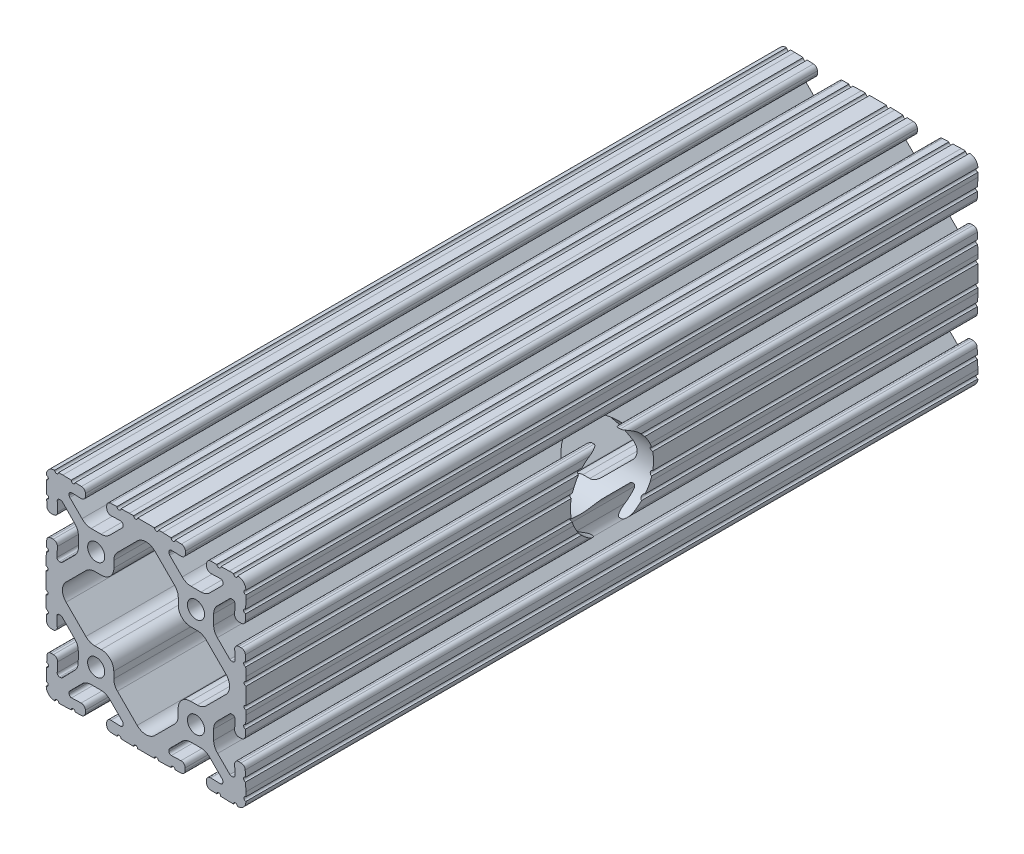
from build123d import *

# Parameters (mm, degrees)
SKETCH2_R           = 3.2639
EXTRUDE2_DEPTH      = 279.4
EXTRUDE3_DEPTH      = 296.237728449
EXTRUDE3_DEPTH_BACK = 296.237728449
SKETCH3_R           = 15.875


with BuildPart() as part:
    # Sketch2 → Extrude2 (new body)
    with BuildSketch(Plane.XY):
        with BuildLine():
            Line((52.454414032, 57.140691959), (50.810145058, 57.140983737))
            Line((50.810145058, 57.140983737), (47.609261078, 57.029766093))
            ThreePointArc((47.609261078, 57.029766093), (46.874190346, 56.241805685), (46.086180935, 56.976823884))
            Line((46.086180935, 56.976823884), (43.693943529, 56.893713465))
            ThreePointArc((43.693943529, 56.893713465), (42.61600037, 56.414012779), (42.173821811, 55.320142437))
            Line((42.173821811, 55.320142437), (42.173659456, 54.405215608))
            ThreePointArc((42.173659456, 54.405215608), (42.654306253, 53.272318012), (43.803128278, 52.831085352))
            Line((43.803128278, 52.831085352), (47.476383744, 52.95867854))
            ThreePointArc((47.476383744, 52.95867854), (48.124912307, 52.709595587), (48.396245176, 52.070056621))
            Line((48.396245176, 52.070056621), (48.396165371, 51.620327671))
            ThreePointArc((48.396165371, 51.620327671), (48.328434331, 51.280135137), (48.135673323, 50.991757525))
            Line((48.135673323, 50.991757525), (43.369419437, 46.227171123))
            ThreePointArc((43.369419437, 46.227171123), (41.828287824, 45.197811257), (40.010548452, 44.836574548))
            Line((40.010548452, 44.836574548), (36.205374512, 44.837249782))
            ThreePointArc((36.205374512, 44.837249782), (34.387769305, 45.199129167), (32.847006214, 46.229029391))
            Line((32.847006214, 46.229029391), (28.08241092, 50.995314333))
            ThreePointArc((28.08241092, 50.995314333), (27.889751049, 51.28376092), (27.822140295, 51.623978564))
            Line((27.822140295, 51.623978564), (27.822224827, 52.1003435))
            ThreePointArc((27.822224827, 52.1003435), (28.093786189, 52.73978761), (28.742405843, 52.988638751))
            Line((28.742405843, 52.988638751), (32.415629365, 52.859723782))
            ThreePointArc((32.415629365, 52.859723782), (33.564612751, 53.300545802), (34.045664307, 54.43327537))
            Line((34.045664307, 54.43327537), (34.045826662, 55.348199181))
            ThreePointArc((34.045826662, 55.348199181), (33.60404324, 56.442219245), (32.526283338, 56.922308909))
            Line((32.526283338, 56.922308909), (30.134056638, 57.006299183))
            ThreePointArc((30.134056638, 57.006299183), (29.345798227, 56.271548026), (28.610994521, 57.059757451))
            Line((28.610994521, 57.059757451), (25.410153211, 57.189179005))
            Line((25.410153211, 57.189179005), (23.784553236, 57.189467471))
            ThreePointArc((23.784553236, 57.189467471), (23.022418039, 56.4276535), (22.26055326, 57.189737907))
            Line((22.26055326, 57.189737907), (15.820815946, 57.195300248))
            ThreePointArc((15.820815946, 57.195300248), (15.058731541, 56.433435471), (14.296815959, 57.195469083))
            Line((14.296815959, 57.195469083), (12.671215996, 57.19585915))
            Line((12.671215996, 57.19585915), (9.470332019, 57.084666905))
            ThreePointArc((9.470332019, 57.084666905), (8.735248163, 56.296718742), (7.947250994, 57.031750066))
            Line((7.947250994, 57.031750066), (5.554994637, 56.948608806))
            ThreePointArc((5.554994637, 56.948608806), (4.477064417, 56.468901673), (4.034892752, 55.375038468))
            Line((4.034892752, 55.375038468), (4.034730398, 54.460116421))
            ThreePointArc((4.034730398, 54.460116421), (4.515381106, 53.327215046), (5.66421009, 52.885986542))
            Line((5.66421009, 52.885986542), (9.337473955, 53.013605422))
            ThreePointArc((9.337473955, 53.013605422), (9.986006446, 52.764524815), (10.257341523, 52.124983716))
            Line((10.257341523, 52.124983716), (10.25725699, 51.64860928))
            ThreePointArc((10.25725699, 51.64860928), (10.189525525, 51.308415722), (9.996763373, 51.020037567))
            Line((9.996763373, 51.020037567), (5.230478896, 46.255444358))
            ThreePointArc((5.230478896, 46.255444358), (3.689350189, 45.226090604), (1.871616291, 44.864856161))
            Line((1.871616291, 44.864856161), (-1.9295089, 44.865530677))
            ThreePointArc((-1.9295089, 44.865530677), (-3.824330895, 45.260212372), (-5.404383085, 46.37804917))
            Line((-5.404383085, 46.37804917), (-10.055977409, 51.023051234))
            ThreePointArc((-10.055977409, 51.023051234), (-10.248872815, 51.300534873), (-10.316797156, 51.631581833))
            Line((-10.316797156, 51.631581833), (-10.316717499, 52.080476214))
            ThreePointArc((-10.316717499, 52.080476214), (-10.045157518, 52.719918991), (-9.396540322, 52.9687716))
            Line((-9.396540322, 52.9687716), (-5.723306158, 52.839872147))
            ThreePointArc((-5.723306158, 52.839872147), (-4.574327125, 53.280696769), (-4.093278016, 54.413423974))
            Line((-4.093278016, 54.413423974), (-4.093115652, 55.328398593))
            ThreePointArc((-4.093115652, 55.328398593), (-4.534916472, 56.42243668), (-5.612709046, 56.902510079))
            Line((-5.612709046, 56.902510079), (-8.004886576, 56.986422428))
            ThreePointArc((-8.004886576, 56.986422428), (-8.793157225, 56.251684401), (-9.527947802, 57.039906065))
            Line((-9.527947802, 57.039906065), (-12.708548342, 57.152255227))
            Line((-12.708548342, 57.152255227), (-14.334148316, 57.152543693))
            ThreePointArc((-14.334148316, 57.152543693), (-15.096232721, 56.390678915), (-15.858148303, 57.152712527))
            ThreePointArc((-15.858148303, 57.152712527), (-18.107533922, 56.228658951), (-19.035674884, 53.980956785))
            ThreePointArc((-19.035674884, 53.980956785), (-18.275033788, 53.217651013), (-19.038288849, 52.456959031))
            Line((-19.038288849, 52.456959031), (-19.040964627, 50.852900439))
            Line((-19.040964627, 50.852900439), (-18.934455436, 47.651856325))
            ThreePointArc((-18.934455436, 47.651856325), (-18.147577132, 46.91562734), (-18.883753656, 46.128699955))
            Line((-18.883753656, 46.128699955), (-18.804162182, 43.736342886))
            ThreePointArc((-18.804162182, 43.736342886), (-18.326047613, 42.657695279), (-17.232828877, 42.213908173))
            Line((-17.232828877, 42.213908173), (-16.317903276, 42.212400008))
            ThreePointArc((-16.317903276, 42.212400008), (-15.184299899, 42.691379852), (-14.74137786, 43.839551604))
            Line((-14.74137786, 43.839551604), (-14.863567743, 47.512990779))
            ThreePointArc((-14.863567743, 47.512990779), (-14.613531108, 48.161152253), (-13.973593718, 48.4315441))
            Line((-13.973593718, 48.4315441), (-13.523865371, 48.430802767))
            ThreePointArc((-13.523865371, 48.430802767), (-13.182899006, 48.362205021), (-12.894344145, 48.168041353))
            Line((-12.894344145, 48.168041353), (-8.158352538, 43.396132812))
            ThreePointArc((-8.158352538, 43.396132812), (-7.13126071, 41.853488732), (-6.772698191, 40.035219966))
            Line((-6.772698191, 40.035219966), (-6.778970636, 36.230051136))
            ThreePointArc((-6.778970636, 36.230051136), (-7.143523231, 34.412980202), (-8.175688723, 32.873733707))
            Line((-8.175688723, 32.873733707), (-12.948976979, 28.116154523))
            ThreePointArc((-12.948976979, 28.116154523), (-13.237706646, 27.92391915), (-13.578023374, 27.856808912))
            Line((-13.578023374, 27.856808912), (-14.05438767, 27.857594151))
            ThreePointArc((-14.05438767, 27.857594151), (-14.693431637, 28.130095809), (-14.941328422, 28.779080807))
            Line((-14.941328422, 28.779080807), (-14.807010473, 32.452110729))
            ThreePointArc((-14.807010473, 32.452110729), (-15.246141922, 33.601741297), (-16.378162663, 34.084458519))
            Line((-16.378162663, 34.084458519), (-17.293085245, 34.085966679))
            ThreePointArc((-17.293085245, 34.085966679), (-18.387753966, 33.645792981), (-18.869428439, 32.568740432))
            Line((-18.869428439, 32.568740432), (-18.956937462, 30.176639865))
            ThreePointArc((-18.956937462, 30.176639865), (-18.223346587, 29.387301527), (-19.012636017, 28.65365803))
            Line((-19.012636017, 28.65365803), (-19.129671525, 25.452982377))
            Line((-19.129671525, 25.452982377), (-19.132351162, 23.827384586))
            ThreePointArc((-19.132351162, 23.827384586), (-18.371659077, 23.064129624), (-19.134863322, 22.303386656))
            Line((-19.134863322, 22.303386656), (-19.145415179, 15.898175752))
            ThreePointArc((-19.145415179, 15.898175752), (-18.384672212, 15.134971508), (-19.147825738, 14.374177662))
            Line((-19.147825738, 14.374177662), (-19.150606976, 12.748580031))
            Line((-19.150606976, 12.748580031), (-19.044123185, 9.54753596))
            ThreePointArc((-19.044123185, 9.54753596), (-18.257257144, 8.811293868), (-18.993446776, 8.024378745))
            Line((-18.993446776, 8.024378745), (-18.91382449, 5.632002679))
            ThreePointArc((-18.91382449, 5.632002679), (-18.435703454, 4.553368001), (-17.342491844, 4.109587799))
            Line((-17.342491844, 4.109587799), (-16.427571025, 4.108079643))
            ThreePointArc((-16.427571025, 4.108079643), (-15.293963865, 4.587063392), (-14.851045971, 5.735242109))
            Line((-14.851045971, 5.735242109), (-14.973261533, 9.408689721))
            ThreePointArc((-14.973261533, 9.408689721), (-14.723227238, 10.056855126), (-14.083287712, 10.327249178))
            Line((-14.083287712, 10.327249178), (-13.606913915, 10.326463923))
            ThreePointArc((-13.606913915, 10.326463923), (-13.266820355, 10.258232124), (-12.978726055, 10.065045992))
            Line((-12.978726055, 10.065045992), (-8.221148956, 5.291758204))
            ThreePointArc((-8.221148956, 5.291758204), (-7.194063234, 3.749117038), (-6.835502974, 1.930853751))
            Line((-6.835502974, 1.930853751), (-6.841768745, -1.870266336))
            ThreePointArc((-6.841768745, -1.870266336), (-7.239237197, -3.764505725), (-8.359396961, -5.342911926))
            Line((-8.359396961, -5.342911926), (-12.897584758, -9.987676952))
            ThreePointArc((-12.897584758, -9.987676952), (-13.186508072, -10.180318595), (-13.527189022, -10.24757909))
            Line((-13.527189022, -10.24757909), (-13.976917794, -10.246837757))
            ThreePointArc((-13.976917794, -10.246837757), (-14.615960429, -9.974337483), (-14.863858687, -9.325354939))
            Line((-14.863858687, -9.325354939), (-14.729556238, -5.652314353))
            ThreePointArc((-14.729556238, -5.652314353), (-15.168690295, -4.502688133), (-16.300708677, -4.019973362))
            Line((-16.300708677, -4.019973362), (-17.215682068, -4.018465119))
            ThreePointArc((-17.215682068, -4.018465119), (-18.310368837, -4.458656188), (-18.792027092, -5.535741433))
            Line((-18.792027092, -5.535741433), (-18.879458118, -7.927792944))
            ThreePointArc((-18.879458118, -7.927792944), (-18.145880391, -8.717143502), (-18.935182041, -9.450773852))
            Line((-18.935182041, -9.450773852), (-19.052245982, -12.668543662))
            Line((-19.052245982, -12.668543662), (-19.05492562, -14.294141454))
            ThreePointArc((-19.05492562, -14.294141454), (-18.294182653, -15.057345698), (-19.057336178, -15.818139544))
            ThreePointArc((-19.057336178, -15.818139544), (-18.110538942, -18.136102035), (-15.778274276, -19.047099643))
            ThreePointArc((-15.778274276, -19.047099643), (-15.016088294, -18.285336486), (-14.254274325, -19.047471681))
            Line((-14.254274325, -19.047471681), (-12.742313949, -19.047739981))
            Line((-12.742313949, -19.047739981), (-9.541429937, -18.936523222))
            ThreePointArc((-9.541429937, -18.936523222), (-8.806359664, -18.148562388), (-8.018349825, -18.883580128))
            Line((-8.018349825, -18.883580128), (-5.626142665, -18.800516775))
            ThreePointArc((-5.626142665, -18.800516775), (-4.54817978, -18.320825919), (-4.10599071, -17.226944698))
            Line((-4.10599071, -17.226944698), (-4.105828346, -16.311970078))
            ThreePointArc((-4.105828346, -16.311970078), (-4.586475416, -15.179072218), (-5.735297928, -14.737839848))
            Line((-5.735297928, -14.737839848), (-9.408577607, -14.865435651))
            ThreePointArc((-9.408577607, -14.865435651), (-10.057106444, -14.616352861), (-10.328439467, -13.976813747))
            Line((-10.328439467, -13.976813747), (-10.328359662, -13.527084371))
            ThreePointArc((-10.328359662, -13.527084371), (-10.260788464, -13.187281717), (-10.068462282, -12.899111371))
            Line((-10.068462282, -12.899111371), (-5.414074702, -8.237522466))
            ThreePointArc((-5.414074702, -8.237522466), (-3.833625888, -7.120246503), (-1.938663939, -6.726237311))
            Line((-1.938663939, -6.726237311), (1.862461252, -6.726911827))
            ThreePointArc((1.862461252, -6.726911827), (3.680066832, -7.088791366), (5.220830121, -8.118692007))
            Line((5.220830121, -8.118692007), (9.985423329, -12.884976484))
            ThreePointArc((9.985423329, -12.884976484), (10.178083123, -13.173423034), (10.245693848, -13.513640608))
            Line((10.245693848, -13.513640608), (10.245609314, -13.990015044))
            ThreePointArc((10.245609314, -13.990015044), (9.974047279, -14.629459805), (9.325426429, -14.87831023))
            Line((9.325426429, -14.87831023), (5.652208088, -14.749387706))
            ThreePointArc((5.652208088, -14.749387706), (4.503222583, -15.190208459), (4.022169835, -16.322939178))
            Line((4.022169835, -16.322939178), (4.022007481, -17.237861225))
            ThreePointArc((4.022007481, -17.237861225), (4.463790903, -18.331881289), (5.541550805, -18.811970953))
            Line((5.541550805, -18.811970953), (7.933777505, -18.895961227))
            ThreePointArc((7.933777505, -18.895961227), (8.722035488, -18.161209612), (9.456839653, -18.949418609))
            Line((9.456839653, -18.949418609), (12.657683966, -19.06174685))
            Line((12.657683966, -19.06174685), (14.283283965, -19.061933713))
            ThreePointArc((14.283283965, -19.061933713), (15.045469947, -18.300170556), (15.807283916, -19.062305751))
            Line((15.807283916, -19.062305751), (22.201759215, -19.063440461))
            ThreePointArc((22.201759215, -19.063440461), (22.963894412, -18.30162649), (23.725759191, -19.063710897))
            Line((23.725759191, -19.063710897), (25.351359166, -19.063999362))
            Line((25.351359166, -19.063999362), (28.552243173, -18.952808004))
            ThreePointArc((28.552243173, -18.952808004), (29.287326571, -18.164859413), (30.075324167, -18.899890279))
            Line((30.075324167, -18.899890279), (32.467580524, -18.816749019))
            ThreePointArc((32.467580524, -18.816749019), (33.545510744, -18.337041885), (33.987682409, -17.24317868))
            Line((33.987682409, -17.24317868), (33.987844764, -16.328254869))
            ThreePointArc((33.987844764, -16.328254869), (33.507195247, -15.195354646), (32.358368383, -14.754124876))
            Line((32.358368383, -14.754124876), (28.685099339, -14.881736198))
            ThreePointArc((28.685099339, -14.881736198), (28.036568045, -14.632654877), (27.76523364, -13.993114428))
            Line((27.76523364, -13.993114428), (27.765318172, -13.516749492))
            ThreePointArc((27.765318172, -13.516749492), (27.833049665, -13.176555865), (28.025811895, -12.888177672))
            Line((28.025811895, -12.888177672), (32.792098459, -8.123584))
            ThreePointArc((32.792098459, -8.123584), (34.333226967, -7.094230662), (36.150960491, -6.732996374))
            Line((36.150960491, -6.732996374), (39.956134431, -6.733671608))
            ThreePointArc((39.956134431, -6.733671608), (41.773745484, -7.095553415), (43.314511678, -8.125460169))
            Line((43.314511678, -8.125460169), (48.079065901, -12.891729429))
            ThreePointArc((48.079065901, -12.891729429), (48.271849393, -13.189016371), (48.339340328, -13.536852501))
            Line((48.339340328, -13.536852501), (48.339260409, -13.987223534))
            ThreePointArc((48.339260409, -13.987223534), (48.067700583, -14.626666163), (47.419083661, -14.875518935))
            Line((47.419083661, -14.875518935), (43.745873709, -14.746622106))
            ThreePointArc((43.745873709, -14.746622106), (42.596895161, -15.187447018), (42.115846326, -16.320173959))
            Line((42.115846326, -16.320173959), (42.11568397, -17.235100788))
            ThreePointArc((42.11568397, -17.235100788), (42.557474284, -18.329127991), (43.635247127, -18.809211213))
            Line((43.635247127, -18.809211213), (46.027454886, -18.893170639))
            ThreePointArc((46.027454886, -18.893170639), (46.815725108, -18.158432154), (47.550516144, -18.946653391))
            Line((47.550516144, -18.946653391), (50.751360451, -19.059007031))
            Line((50.751360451, -19.059007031), (52.376935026, -19.059295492))
            ThreePointArc((52.376935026, -19.059295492), (53.124299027, -18.297428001), (53.871496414, -19.059458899))
            ThreePointArc((53.871496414, -19.059458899), (56.204100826, -18.149298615), (57.151729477, -15.83166296))
            ThreePointArc((57.151729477, -15.83166296), (56.388846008, -15.070598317), (57.14985979, -14.307664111))
            Line((57.14985979, -14.307664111), (57.147760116, -12.664971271))
            Line((57.147760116, -12.664971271), (57.031835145, -9.464254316))
            ThreePointArc((57.031835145, -9.464254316), (56.242793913, -8.730343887), (56.976651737, -7.941253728))
            Line((56.976651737, -7.941253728), (56.890069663, -5.549171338))
            ThreePointArc((56.890069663, -5.549171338), (56.408793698, -4.471915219), (55.314263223, -4.03133567))
            Line((55.314263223, -4.03133567), (54.403855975, -4.032513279))
            ThreePointArc((54.403855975, -4.032513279), (53.280400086, -4.516317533), (52.856981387, -5.66389607))
            Line((52.856981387, -5.66389607), (52.989995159, -9.33739571))
            ThreePointArc((52.989995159, -9.33739571), (52.741866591, -9.986290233), (52.102727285, -10.258563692))
            Line((52.102727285, -10.258563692), (51.652998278, -10.259145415))
            ThreePointArc((51.652998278, -10.259145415), (51.31234122, -10.191764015), (51.023486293, -9.999019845))
            Line((51.023486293, -9.999019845), (46.373307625, -5.352624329))
            ThreePointArc((46.373307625, -5.352624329), (45.253708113, -3.773820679), (44.856911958, -1.879440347))
            Line((44.856911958, -1.879440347), (44.851995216, 1.921681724))
            ThreePointArc((44.851995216, 1.921681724), (45.211200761, 3.739817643), (46.238833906, 5.282094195))
            Line((46.238833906, 5.282094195), (50.99810476, 10.053693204))
            ThreePointArc((50.99810476, 10.053693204), (51.286267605, 10.246777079), (51.626385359, 10.314888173))
            Line((51.626385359, 10.314888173), (52.102759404, 10.315504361))
            ThreePointArc((52.102759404, 10.315504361), (52.742602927, 10.04488321), (52.99240717, 9.396629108))
            Line((52.99240717, 9.396629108), (52.868887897, 5.723225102))
            ThreePointArc((52.868887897, 5.723225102), (53.311398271, 4.574889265), (54.444835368, 4.095503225))
            Line((54.444835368, 4.095503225), (55.359756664, 4.096686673))
            ThreePointArc((55.359756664, 4.096686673), (56.453125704, 4.540078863), (56.93162952, 5.618543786))
            Line((56.93162952, 5.618543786), (57.012100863, 8.010891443))
            ThreePointArc((57.012100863, 8.010891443), (56.276190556, 8.798067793), (57.063317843, 9.534030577))
            Line((57.063317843, 9.534030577), (57.177262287, 12.735035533))
            Line((57.177262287, 12.735035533), (57.175057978, 14.360634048))
            ThreePointArc((57.175057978, 14.360634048), (56.412174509, 15.121698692), (57.173188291, 15.884632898))
            Line((57.173188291, 15.884632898), (57.20384708, 22.285420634))
            ThreePointArc((57.20384708, 22.285420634), (56.440912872, 23.046434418), (57.201875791, 23.809419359))
            Line((57.201875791, 23.809419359), (57.199773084, 25.435017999))
            Line((57.199773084, 25.435017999), (57.083870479, 28.618640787))
            ThreePointArc((57.083870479, 28.618640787), (56.294841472, 29.352564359), (57.028712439, 30.141642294))
            Line((57.028712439, 30.141642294), (56.942052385, 32.533773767))
            ThreePointArc((56.942052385, 32.533773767), (56.460760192, 33.610997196), (55.366247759, 34.051559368))
            Line((55.366247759, 34.051559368), (54.451324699, 34.050375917))
            ThreePointArc((54.451324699, 34.050375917), (53.319132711, 33.568060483), (52.879593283, 32.418585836))
            Line((52.879593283, 32.418585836), (53.012607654, 28.745508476))
            ThreePointArc((53.012607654, 28.745508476), (52.764480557, 28.096611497), (52.125339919, 27.824336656))
            Line((52.125339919, 27.824336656), (51.648975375, 27.82372048))
            ThreePointArc((51.648975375, 27.82372048), (51.308682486, 27.890951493), (51.020021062, 28.083289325))
            Line((51.020021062, 28.083289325), (46.248421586, 32.842562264))
            ThreePointArc((46.248421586, 32.842562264), (45.216802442, 34.382174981), (44.852894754, 36.199375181))
            Line((44.852894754, 36.199375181), (44.847972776, 40.004545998))
            ThreePointArc((44.847972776, 40.004545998), (45.207180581, 41.822687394), (46.234819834, 43.364966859))
            Line((46.234819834, 43.364966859), (50.994073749, 48.136525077))
            ThreePointArc((50.994073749, 48.136525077), (51.291887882, 48.329738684), (51.640316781, 48.397724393))
            Line((51.640316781, 48.397724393), (52.090785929, 48.398307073))
            ThreePointArc((52.090785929, 48.398307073), (52.730627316, 48.127688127), (52.980433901, 47.479437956))
            Line((52.980433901, 47.479437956), (52.856940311, 43.806042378))
            ThreePointArc((52.856940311, 43.806042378), (53.299454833, 42.657713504), (54.432888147, 42.17833137))
            Line((54.432888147, 42.17833137), (55.347814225, 42.179514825))
            ThreePointArc((55.347814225, 42.179514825), (56.441190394, 42.622913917), (56.919687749, 43.701391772))
            Line((56.919687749, 43.701391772), (57.000128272, 46.093720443))
            ThreePointArc((57.000128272, 46.093720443), (56.264231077, 46.88090905), (57.051370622, 47.616858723))
            Line((57.051370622, 47.616858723), (57.159015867, 50.817864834))
            Line((57.159015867, 50.817864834), (57.156913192, 52.443438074))
            ThreePointArc((57.156913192, 52.443438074), (56.393928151, 53.20440089), (57.154840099, 53.967436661))
            ThreePointArc((57.154840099, 53.967436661), (56.223687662, 56.211702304), (53.978414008, 57.140421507))
            ThreePointArc((53.978414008, 57.140421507), (53.216278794, 56.378556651), (52.454414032, 57.140691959))
        make_face()
        with Locations((38.106764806, 38.093237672)):
            Circle(SKETCH2_R, mode=Mode.SUBTRACT)
        with Locations((0.006760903, 38.099993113)):
            Circle(SKETCH2_R, mode=Mode.SUBTRACT)
        Circle(SKETCH2_R, mode=Mode.SUBTRACT)
        with Locations((38.099999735, -0.006760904)):
            Circle(SKETCH2_R, mode=Mode.SUBTRACT)
        with BuildLine():
            Line((41.993101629, 29.973451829), (49.558646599, 22.416916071))
            ThreePointArc((49.558646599, 22.416916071), (50.929743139, 19.049991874), (49.518516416, 15.699689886))
            Line((49.518516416, 15.699689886), (41.952971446, 8.143154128))
            ThreePointArc((41.952971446, 8.143154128), (40.412330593, 7.114824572), (38.595514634, 6.753970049))
            Line((38.595514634, 6.753970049), (36.049315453, 6.754421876))
            ThreePointArc((36.049315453, 6.754421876), (32.690452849, 5.363833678), (31.298672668, 2.00546481))
            Line((31.298672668, 2.00546481), (31.298220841, -0.540734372))
            ThreePointArc((31.298220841, -0.540734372), (30.936341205, -2.358340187), (29.9064403, -3.899103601))
            Line((29.9064403, -3.899103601), (22.359091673, -11.443772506))
            ThreePointArc((22.359091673, -11.443772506), (19.005626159, -12.832125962), (15.652653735, -11.442582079))
            Line((15.652653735, -11.442582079), (8.107984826, -3.895235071))
            ThreePointArc((8.107984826, -3.895235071), (7.078631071, -2.354106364), (6.717396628, -0.536372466))
            Line((6.717396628, -0.536372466), (6.717848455, 2.009826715))
            ThreePointArc((6.717848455, 2.009826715), (5.327260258, 5.368689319), (1.968891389, 6.7604695))
            Line((1.968891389, 6.7604695), (-0.577317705, 6.760921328))
            ThreePointArc((-0.577317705, 6.760921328), (-2.394921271, 7.122800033), (-3.935683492, 8.152698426))
            Line((-3.935683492, 8.152698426), (-11.489268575, 15.708950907))
            ThreePointArc((-11.489268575, 15.708950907), (-12.869914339, 18.740124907), (-11.923108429, 21.933517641))
            Line((-11.923108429, 21.933517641), (-3.895553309, 29.963907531))
            ThreePointArc((-3.895553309, 29.963907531), (-2.354791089, 30.993805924), (-0.537187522, 31.355684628))
            Line((-0.537187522, 31.355684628), (2.009021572, 31.356136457))
            ThreePointArc((2.009021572, 31.356136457), (5.367390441, 32.747916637), (6.757978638, 36.106779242))
            Line((6.757978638, 36.106779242), (6.757526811, 38.652978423))
            ThreePointArc((6.757526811, 38.652978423), (7.118761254, 40.470712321), (8.148115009, 42.011841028))
            Line((8.148115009, 42.011841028), (15.692783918, 49.559188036))
            ThreePointArc((15.692783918, 49.559188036), (19.045756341, 50.948731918), (22.399221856, 49.560378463))
            Line((22.399221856, 49.560378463), (29.946570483, 42.015709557))
            ThreePointArc((29.946570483, 42.015709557), (30.976471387, 40.474946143), (31.338351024, 38.657340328))
            Line((31.338351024, 38.657340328), (31.338802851, 36.111141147))
            ThreePointArc((31.338802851, 36.111141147), (32.730583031, 32.752772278), (36.089445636, 31.362184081))
            Line((36.089445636, 31.362184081), (38.635644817, 31.362635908))
            ThreePointArc((38.635644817, 31.362635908), (40.452460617, 31.001781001), (41.993101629, 29.973451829))
        make_face(mode=Mode.SUBTRACT)
    extrude(amount=EXTRUDE2_DEPTH)

    # Sketch3 → Extrude3 (cut, two sides: drawn at the far end of the back side and taken through both)
    with BuildSketch(Plane(origin=(-19.171553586, 0.031582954, 0), x_dir=(0, 0, 1), z_dir=(-0.9999986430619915, 0.001647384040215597, 0)).offset(-EXTRUDE3_DEPTH_BACK)):
        with Locations(Location((139.7, 19.069224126, 0), (0, 0, 249.648547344))):
            Circle(SKETCH3_R)
    extrude(amount=EXTRUDE3_DEPTH + EXTRUDE3_DEPTH_BACK, mode=Mode.SUBTRACT)


solid = part.part
